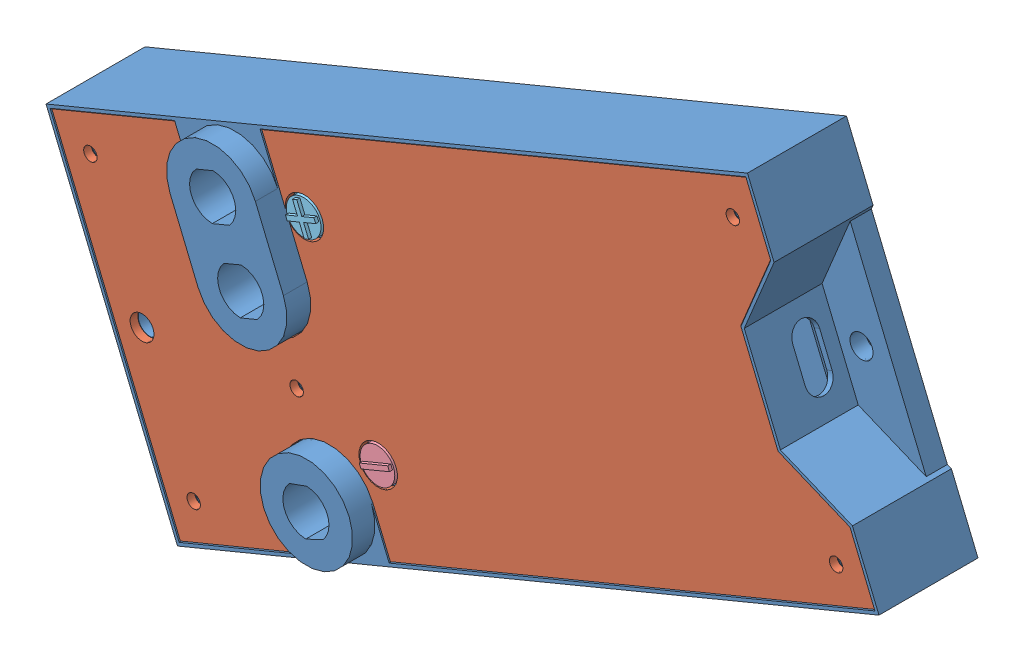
SolidWorks assembly boitier carte eclectronique.SLDASM, configuration Défaut (file format 12000). Lengths in mm.
Overall size (216.2 157.8 31.5).
5 component instances, 5 part files, 12 mates.
Components (placement in the parent):
- boitier carte EVEIA V3-1: boitier carte EVEIA V3.SLDPRT [Défaut] at (-101.7268 -24.3091 -39.1578) x (0.923728 0.383049 0) z (0 0 1) size (197.1 89.1 31.5)
- vitreboitier carte electronique-1: vitreboitier carte electronique.SLDPRT [Défaut] at (-90.3696 27.712 -15.6578) x (0.923728 0.383049 0) z (0.383049 -0.923728 0) size (195.1 2 87.1)
- verrou carte-1: verrou carte.SLDPRT [Défaut] at (-42.1472 77.5581 -27.7578) x (0.923728 0.383049 0) z (0.383049 -0.923728 0) size (12.6 12.1 31.6)
- Bouton --1: Bouton -.SLDPRT [Défaut] at (-104.0031 -5.7667 -23.4578) x (-0.923728 -0.383049 0) z (-0.383049 0.923728 0) size (9 10.8 9)
- Bouton +-1: Bouton +.SLDPRT [Défaut] at (-123.1556 40.4197 -23.4578) x (-0.923728 -0.383049 0) z (-0.383049 0.923728 0) size (9 10.8 9)
Mates (geometry in assembly coordinates):
- Coaxiale1: concentric anti-aligned: cylinder of boitier carte EVEIA V3-1 through (-178.6978 26.86 -37.6578) axis (0 0 1) radius 1.475; cylinder of vitreboitier carte electronique-1 through (-178.6978 26.86 -13.6578) axis (0 0 -1) radius 1.75
- Coïncidente3: coincident anti-aligned: plane of boitier carte EVEIA V3-1 through (-101.7268 -24.3091 -15.6578) normal (0 0 1); plane of vitreboitier carte electronique-1 through (-116.6421 -19.6684 -15.6578) normal (0 0 -1)
- Coaxiale2: concentric anti-aligned: cylinder of boitier carte EVEIA V3-1 through (14.8485 31.3394 -37.6578) axis (0 0 1) radius 1.475; cylinder of vitreboitier carte electronique-1 through (14.8485 31.3394 -13.6578) axis (0 0 -1) radius 1.75
- Coaxiale3: concentric anti-aligned: cylinder of boitier carte EVEIA V3-1 through (-11.6548 86.1152 -27.7578) axis (0 0 1) radius 5; cylinder of verrou carte-1 through (-11.6548 86.1152 -15.6578) axis (0 0 -1) radius 4.8
- Parallèle3: parallel anti-aligned: line of boitier carte EVEIA V3-1 through (10.5061 22.2314 -15.6578) axis (-0.383049 0.923728 0); line of verrou carte-1 through (-24.912 97.7224 -15.6578) axis (0.383049 -0.923728 0)
- Coïncidente7: coincident anti-aligned: plane of boitier carte EVEIA V3-1 through (-11.6548 86.1152 -27.7578) normal (0 0 1); plane of verrou carte-1 through (-11.6548 86.1152 -27.7578) normal (0 0 -1)
- Coaxiale4: concentric aligned: cylinder of vitreboitier carte electronique-1 through (-123.1556 40.4197 -13.6578) axis (0 0 -1) radius 5; cylinder of Bouton +-1 through (-123.1556 40.4197 -13.4578) axis (0 0 -1) radius 4.5
- Coaxiale5: concentric aligned: cylinder of vitreboitier carte electronique-1 through (-104.0031 -5.7667 -13.6578) axis (0 0 -1) radius 5; cylinder of Bouton --1 through (-104.0031 -5.7667 -13.4578) axis (0 0 -1) radius 4.5
- Parallèle4: parallel aligned: plane of boitier carte EVEIA V3-1 through (-100.6509 2.3353 -27.6578) normal (0.923728 0.383049 0); plane of Bouton --1 through (-98.1226 -8.1998 -15.6578) normal (0.923728 0.383049 0)
- Coïncidente9: coincident aligned: plane of boitier carte EVEIA V3-1 through (-116.6421 -19.6684 -13.4578) normal (0 0 1); plane of Bouton --1 through (-104.0031 -5.7667 -13.4578) normal (0 0 1)
- Parallèle5: parallel aligned: plane of boitier carte EVEIA V3-1 through (-101.7268 -24.3091 -15.6578) normal (0.923728 0.383049 0); plane of Bouton +-1 through (-117.2751 37.9866 -15.6578) normal (0.923728 0.383049 0)
- Coïncidente11: coincident aligned: plane of boitier carte EVEIA V3-1 through (-116.6421 -19.6684 -13.4578) normal (0 0 1); plane of Bouton +-1 through (-123.1556 40.4197 -13.4578) normal (0 0 1)
